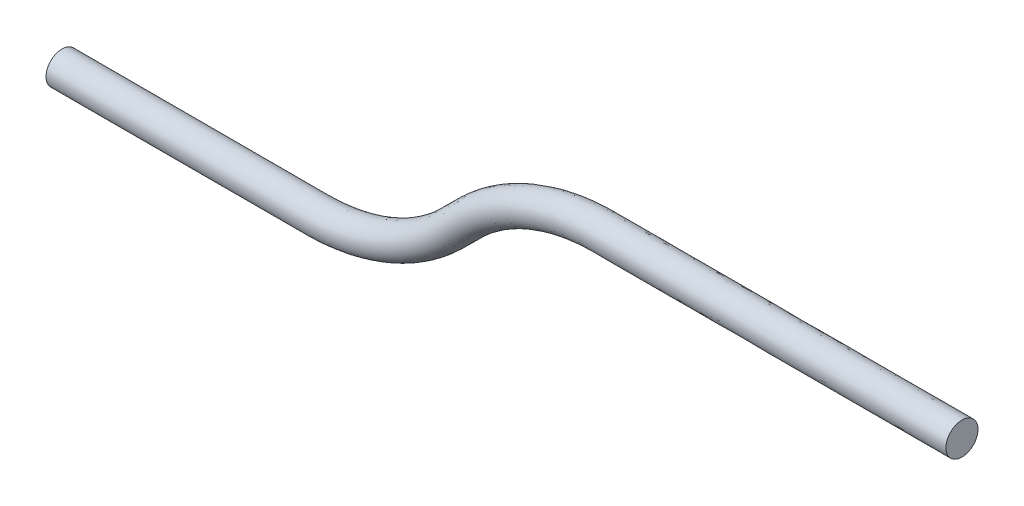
ISO-10303-21;
HEADER;
FILE_DESCRIPTION(('STEP AP214'),'2;1');
FILE_NAME('part.step','',(''),(''),'','','');
FILE_SCHEMA(('AUTOMOTIVE_DESIGN { 1 0 10303 214 1 1 1 1 }'));
ENDSEC;
DATA;
#1=APPLICATION_CONTEXT('core data for automotive mechanical design processes');
#2=APPLICATION_PROTOCOL_DEFINITION('international standard','automotive_design',2000,#1);
#3=PRODUCT_CONTEXT('',#1,'mechanical');
#4=PRODUCT('Part','Part','',(#3));
#5=PRODUCT_RELATED_PRODUCT_CATEGORY('part','',(#4));
#6=PRODUCT_DEFINITION_FORMATION('','',#4);
#7=PRODUCT_DEFINITION_CONTEXT('part definition',#1,'design');
#8=PRODUCT_DEFINITION('design','',#6,#7);
#9=PRODUCT_DEFINITION_SHAPE('','',#8);
#10=(LENGTH_UNIT() NAMED_UNIT(*) SI_UNIT(.MILLI.,.METRE.));
#11=(NAMED_UNIT(*) PLANE_ANGLE_UNIT() SI_UNIT($,.RADIAN.));
#12=(NAMED_UNIT(*) SI_UNIT($,.STERADIAN.) SOLID_ANGLE_UNIT());
#13=UNCERTAINTY_MEASURE_WITH_UNIT(LENGTH_MEASURE(1.E-05),#10,'distance_accuracy_value','');
#14=(GEOMETRIC_REPRESENTATION_CONTEXT(3) GLOBAL_UNCERTAINTY_ASSIGNED_CONTEXT((#13)) GLOBAL_UNIT_ASSIGNED_CONTEXT((#10,
#11,#12)) REPRESENTATION_CONTEXT('',''));
#15=CARTESIAN_POINT('',(0.,0.,0.));
#16=DIRECTION('',(0.,0.,1.));
#17=DIRECTION('',(1.,0.,0.));
#18=AXIS2_PLACEMENT_3D('',#15,#16,#17);
#19=CARTESIAN_POINT('',(0.,62.1823901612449,0.));
#20=DIRECTION('',(1.,0.,0.));
#21=DIRECTION('',(0.,1.,0.));
#22=AXIS2_PLACEMENT_3D('',#19,#20,#21);
#23=PLANE('',#22);
#24=CARTESIAN_POINT('',(0.,57.2125,0.));
#25=CARTESIAN_POINT('',(0.,57.2125,0.741304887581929));
#26=CARTESIAN_POINT('',(0.,57.9264872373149,2.22391466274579));
#27=CARTESIAN_POINT('',(0.,60.3329593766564,2.77317622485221));
#28=CARTESIAN_POINT('',(0.,62.2628001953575,1.23417952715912));
#29=CARTESIAN_POINT('',(0.,62.2628001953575,-1.23417952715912));
#30=CARTESIAN_POINT('',(0.,60.3329593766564,-2.77317622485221));
#31=CARTESIAN_POINT('',(0.,57.9264872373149,-2.22391466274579));
#32=CARTESIAN_POINT('',(0.,57.2125,-0.741304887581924));
#33=CARTESIAN_POINT('',(0.,57.2125,0.));
#34=B_SPLINE_CURVE_WITH_KNOTS('',3,(#24,#25,#26,#27,#28,#29,#30,#31,#32,#33),.UNSPECIFIED.,.T.,
.F.,(4,1,1,1,1,1,1,4),(0.,0.142857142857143,0.285714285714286,0.428571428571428,
0.571428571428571,0.714285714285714,0.857142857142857,1.),.UNSPECIFIED.);
#35=CARTESIAN_POINT('',(0.,57.2125,0.));
#36=VERTEX_POINT('',#35);
#37=EDGE_CURVE('E24',#36,#36,#34,.T.);
#38=ORIENTED_EDGE('',*,*,#37,.T.);
#39=EDGE_LOOP('',(#38));
#40=FACE_BOUND('',#39,.T.);
#41=ADVANCED_FACE('F14',(#40),#23,.F.);
#42=CARTESIAN_POINT('',(139.3,82.0823901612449,0.));
#43=DIRECTION('',(1.,0.,0.));
#44=DIRECTION('',(0.,0.,-1.));
#45=AXIS2_PLACEMENT_3D('',#42,#43,#44);
#46=PLANE('',#45);
#47=CARTESIAN_POINT('',(139.3,77.1125,0.));
#48=CARTESIAN_POINT('',(139.3,77.1125,0.741304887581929));
#49=CARTESIAN_POINT('',(139.3,77.8264872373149,2.22391466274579));
#50=CARTESIAN_POINT('',(139.3,80.2329593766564,2.77317622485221));
#51=CARTESIAN_POINT('',(139.3,82.1628001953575,1.23417952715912));
#52=CARTESIAN_POINT('',(139.3,82.1628001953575,-1.23417952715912));
#53=CARTESIAN_POINT('',(139.3,80.2329593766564,-2.77317622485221));
#54=CARTESIAN_POINT('',(139.3,77.8264872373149,-2.22391466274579));
#55=CARTESIAN_POINT('',(139.3,77.1125,-0.741304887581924));
#56=CARTESIAN_POINT('',(139.3,77.1125,0.));
#57=B_SPLINE_CURVE_WITH_KNOTS('',3,(#47,#48,#49,#50,#51,#52,#53,#54,#55,#56),.UNSPECIFIED.,.T.,
.F.,(4,1,1,1,1,1,1,4),(0.,0.142857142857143,0.285714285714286,0.428571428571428,
0.571428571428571,0.714285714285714,0.857142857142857,1.),.UNSPECIFIED.);
#58=CARTESIAN_POINT('',(139.3,77.1125,0.));
#59=VERTEX_POINT('',#58);
#60=EDGE_CURVE('E10',#59,#59,#57,.F.);
#61=ORIENTED_EDGE('',*,*,#60,.T.);
#62=EDGE_LOOP('',(#61));
#63=FACE_BOUND('',#62,.T.);
#64=ADVANCED_FACE('F16',(#63),#46,.T.);
#65=CARTESIAN_POINT('',(0.,57.2125,0.));
#66=CARTESIAN_POINT('',(13.1252417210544,57.2125,0.));
#67=CARTESIAN_POINT('',(26.2504834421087,57.2125,0.));
#68=CARTESIAN_POINT('',(39.3757251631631,57.2125,0.));
#69=CARTESIAN_POINT('',(41.4927184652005,57.2125,0.));
#70=CARTESIAN_POINT('',(45.7248946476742,57.6294208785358,0.));
#71=CARTESIAN_POINT('',(51.8305417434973,59.4814128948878,0.));
#72=CARTESIAN_POINT('',(57.4574423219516,62.4892012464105,0.));
#73=CARTESIAN_POINT('',(60.7448503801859,65.1869941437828,0.));
#74=CARTESIAN_POINT('',(62.2417906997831,66.68393446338,0.));
#75=CARTESIAN_POINT('',(63.0465489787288,67.4886927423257,0.));
#76=CARTESIAN_POINT('',(63.8513072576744,68.2934510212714,0.));
#77=CARTESIAN_POINT('',(64.6560655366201,69.098209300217,0.));
#78=CARTESIAN_POINT('',(65.9220201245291,70.364163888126,0.));
#79=CARTESIAN_POINT('',(68.7046446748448,72.647918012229,0.));
#80=CARTESIAN_POINT('',(73.4656194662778,75.19256472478,0.));
#81=CARTESIAN_POINT('',(78.6314739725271,76.7597453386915,0.));
#82=CARTESIAN_POINT('',(82.2139446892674,77.1125,0.));
#83=CARTESIAN_POINT('',(84.0042748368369,77.1125,0.));
#84=CARTESIAN_POINT('',(102.436183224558,77.1125,0.));
#85=CARTESIAN_POINT('',(120.868091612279,77.1125,0.));
#86=CARTESIAN_POINT('',(139.3,77.1125,0.));
#87=CARTESIAN_POINT('',(0.,57.2125,0.741304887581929));
#88=CARTESIAN_POINT('',(13.1252417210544,57.2125,0.741304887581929));
#89=CARTESIAN_POINT('',(26.2504834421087,57.2125,0.741304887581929));
#90=CARTESIAN_POINT('',(39.3757251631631,57.2125,0.741304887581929));
#91=CARTESIAN_POINT('',(41.4927184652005,57.2125,0.741304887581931));
#92=CARTESIAN_POINT('',(45.7248946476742,57.6294208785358,0.741304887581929));
#93=CARTESIAN_POINT('',(51.8305417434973,59.4814128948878,0.741304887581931));
#94=CARTESIAN_POINT('',(57.4574423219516,62.4892012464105,0.741304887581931));
#95=CARTESIAN_POINT('',(60.7448503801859,65.1869941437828,0.741304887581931));
#96=CARTESIAN_POINT('',(62.2417906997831,66.68393446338,0.741304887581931));
#97=CARTESIAN_POINT('',(63.0465489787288,67.4886927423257,0.741304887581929));
#98=CARTESIAN_POINT('',(63.8513072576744,68.2934510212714,0.741304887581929));
#99=CARTESIAN_POINT('',(64.6560655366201,69.098209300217,0.741304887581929));
#100=CARTESIAN_POINT('',(65.9220201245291,70.364163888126,0.741304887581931));
#101=CARTESIAN_POINT('',(68.7046446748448,72.647918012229,0.741304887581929));
#102=CARTESIAN_POINT('',(73.4656194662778,75.19256472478,0.741304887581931));
#103=CARTESIAN_POINT('',(78.6314739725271,76.7597453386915,0.741304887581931));
#104=CARTESIAN_POINT('',(82.2139446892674,77.1125,0.741304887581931));
#105=CARTESIAN_POINT('',(84.0042748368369,77.1125,0.741304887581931));
#106=CARTESIAN_POINT('',(102.436183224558,77.1125,0.741304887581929));
#107=CARTESIAN_POINT('',(120.868091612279,77.1125,0.741304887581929));
#108=CARTESIAN_POINT('',(139.3,77.1125,0.741304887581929));
#109=CARTESIAN_POINT('',(0.,57.9264872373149,2.22391466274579));
#110=CARTESIAN_POINT('',(13.1252417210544,57.9264872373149,2.22391466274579));
#111=CARTESIAN_POINT('',(26.2504834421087,57.9264872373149,2.22391466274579));
#112=CARTESIAN_POINT('',(39.3757251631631,57.9264872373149,2.22391466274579));
#113=CARTESIAN_POINT('',(41.4458373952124,57.9264872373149,2.22391466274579));
#114=CARTESIAN_POINT('',(45.5847710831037,58.3341992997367,2.22391466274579));
#115=CARTESIAN_POINT('',(51.5555438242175,60.1453166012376,2.22391466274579));
#116=CARTESIAN_POINT('',(57.0581710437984,63.0866371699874,2.22391466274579));
#117=CARTESIAN_POINT('',(60.2731350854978,65.7250092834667,2.22391466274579));
#118=CARTESIAN_POINT('',(61.7369254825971,67.188799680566,2.22391466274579));
#119=CARTESIAN_POINT('',(62.5416837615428,67.9935579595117,2.22391466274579));
#120=CARTESIAN_POINT('',(63.3464420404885,68.7983162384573,2.22391466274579));
#121=CARTESIAN_POINT('',(64.1512003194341,69.603074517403,2.22391466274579));
#122=CARTESIAN_POINT('',(65.450304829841,70.9021790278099,2.22391466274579));
#123=CARTESIAN_POINT('',(68.3053733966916,73.2453539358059,2.22391466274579));
#124=CARTESIAN_POINT('',(73.1906215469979,75.8564684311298,2.22391466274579));
#125=CARTESIAN_POINT('',(78.4913504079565,77.4645237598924,2.22391466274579));
#126=CARTESIAN_POINT('',(82.1670636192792,77.8264872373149,2.22391466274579));
#127=CARTESIAN_POINT('',(84.0042748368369,77.8264872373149,2.22391466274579));
#128=CARTESIAN_POINT('',(102.436183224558,77.8264872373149,2.22391466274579));
#129=CARTESIAN_POINT('',(120.868091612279,77.8264872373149,2.22391466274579));
#130=CARTESIAN_POINT('',(139.3,77.8264872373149,2.22391466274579));
#131=CARTESIAN_POINT('',(0.,60.3329593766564,2.77317622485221));
#132=CARTESIAN_POINT('',(13.1252417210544,60.3329593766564,2.77317622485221));
#133=CARTESIAN_POINT('',(26.2504834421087,60.3329593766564,2.77317622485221));
#134=CARTESIAN_POINT('',(39.3757251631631,60.3329593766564,2.77317622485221));
#135=CARTESIAN_POINT('',(41.2878261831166,60.3329593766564,2.77317622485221));
#136=CARTESIAN_POINT('',(45.1124888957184,60.7096334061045,2.77317622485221));
#137=CARTESIAN_POINT('',(50.6286717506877,62.3829837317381,2.77317622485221));
#138=CARTESIAN_POINT('',(55.7124394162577,65.1002766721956,2.77317622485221));
#139=CARTESIAN_POINT('',(58.6832331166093,67.5383728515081,2.77317622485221));
#140=CARTESIAN_POINT('',(60.0352927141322,68.8904324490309,2.77317622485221));
#141=CARTESIAN_POINT('',(60.8400509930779,69.6951907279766,2.77317622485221));
#142=CARTESIAN_POINT('',(61.6448092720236,70.4999490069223,2.77317622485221));
#143=CARTESIAN_POINT('',(62.4495675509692,71.3047072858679,2.77317622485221));
#144=CARTESIAN_POINT('',(63.8604028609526,72.7155425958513,2.77317622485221));
#145=CARTESIAN_POINT('',(66.9596417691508,75.2589934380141,2.77317622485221));
#146=CARTESIAN_POINT('',(72.2637494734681,78.0941355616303,2.77317622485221));
#147=CARTESIAN_POINT('',(78.0190682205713,79.8399578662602,2.77317622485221));
#148=CARTESIAN_POINT('',(82.0090524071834,80.2329593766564,2.77317622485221));
#149=CARTESIAN_POINT('',(84.0042748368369,80.2329593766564,2.77317622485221));
#150=CARTESIAN_POINT('',(102.436183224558,80.2329593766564,2.77317622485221));
#151=CARTESIAN_POINT('',(120.868091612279,80.2329593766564,2.77317622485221));
#152=CARTESIAN_POINT('',(139.3,80.2329593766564,2.77317622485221));
#153=CARTESIAN_POINT('',(0.,62.2628001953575,1.23417952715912));
#154=CARTESIAN_POINT('',(13.1252417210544,62.2628001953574,1.23417952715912));
#155=CARTESIAN_POINT('',(26.2504834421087,62.2628001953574,1.23417952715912));
#156=CARTESIAN_POINT('',(39.3757251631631,62.2628001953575,1.23417952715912));
#157=CARTESIAN_POINT('',(41.1611110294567,62.2628001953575,1.23417952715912));
#158=CARTESIAN_POINT('',(44.7337479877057,62.6145836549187,1.23417952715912));
#159=CARTESIAN_POINT('',(49.8853780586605,64.1774534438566,1.23417952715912));
#160=CARTESIAN_POINT('',(54.6332464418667,66.7150901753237,1.23417952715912));
#161=CARTESIAN_POINT('',(57.4082307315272,68.9925775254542,1.23417952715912));
#162=CARTESIAN_POINT('',(58.6706891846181,70.255035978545,1.23417952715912));
#163=CARTESIAN_POINT('',(59.4754474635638,71.0597942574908,1.23417952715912));
#164=CARTESIAN_POINT('',(60.2802057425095,71.8645525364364,1.23417952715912));
#165=CARTESIAN_POINT('',(61.0849640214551,72.669310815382,1.23417952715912));
#166=CARTESIAN_POINT('',(62.5854004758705,74.1697472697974,1.23417952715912));
#167=CARTESIAN_POINT('',(65.8804487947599,76.8738069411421,1.23417952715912));
#168=CARTESIAN_POINT('',(71.5204557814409,79.8886052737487,1.23417952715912));
#169=CARTESIAN_POINT('',(77.6403273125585,81.7449081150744,1.23417952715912));
#170=CARTESIAN_POINT('',(81.8823372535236,82.1628001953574,1.23417952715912));
#171=CARTESIAN_POINT('',(84.0042748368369,82.1628001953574,1.23417952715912));
#172=CARTESIAN_POINT('',(102.436183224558,82.1628001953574,1.23417952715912));
#173=CARTESIAN_POINT('',(120.868091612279,82.1628001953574,1.23417952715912));
#174=CARTESIAN_POINT('',(139.3,82.1628001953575,1.23417952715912));
#175=CARTESIAN_POINT('',(0.,62.2628001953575,-1.23417952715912));
#176=CARTESIAN_POINT('',(13.1252417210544,62.2628001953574,-1.23417952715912));
#177=CARTESIAN_POINT('',(26.2504834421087,62.2628001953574,-1.23417952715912));
#178=CARTESIAN_POINT('',(39.3757251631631,62.2628001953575,-1.23417952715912));
#179=CARTESIAN_POINT('',(41.1611110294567,62.2628001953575,-1.23417952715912));
#180=CARTESIAN_POINT('',(44.7337479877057,62.6145836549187,-1.23417952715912));
#181=CARTESIAN_POINT('',(49.8853780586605,64.1774534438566,-1.23417952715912));
#182=CARTESIAN_POINT('',(54.6332464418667,66.7150901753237,-1.23417952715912));
#183=CARTESIAN_POINT('',(57.4082307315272,68.9925775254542,-1.23417952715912));
#184=CARTESIAN_POINT('',(58.6706891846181,70.255035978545,-1.23417952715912));
#185=CARTESIAN_POINT('',(59.4754474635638,71.0597942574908,-1.23417952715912));
#186=CARTESIAN_POINT('',(60.2802057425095,71.8645525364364,-1.23417952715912));
#187=CARTESIAN_POINT('',(61.0849640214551,72.669310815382,-1.23417952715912));
#188=CARTESIAN_POINT('',(62.5854004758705,74.1697472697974,-1.23417952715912));
#189=CARTESIAN_POINT('',(65.8804487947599,76.8738069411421,-1.23417952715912));
#190=CARTESIAN_POINT('',(71.5204557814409,79.8886052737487,-1.23417952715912));
#191=CARTESIAN_POINT('',(77.6403273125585,81.7449081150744,-1.23417952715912));
#192=CARTESIAN_POINT('',(81.8823372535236,82.1628001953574,-1.23417952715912));
#193=CARTESIAN_POINT('',(84.0042748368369,82.1628001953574,-1.23417952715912));
#194=CARTESIAN_POINT('',(102.436183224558,82.1628001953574,-1.23417952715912));
#195=CARTESIAN_POINT('',(120.868091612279,82.1628001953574,-1.23417952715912));
#196=CARTESIAN_POINT('',(139.3,82.1628001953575,-1.23417952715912));
#197=CARTESIAN_POINT('',(0.,60.3329593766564,-2.77317622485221));
#198=CARTESIAN_POINT('',(13.1252417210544,60.3329593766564,-2.77317622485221));
#199=CARTESIAN_POINT('',(26.2504834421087,60.3329593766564,-2.77317622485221));
#200=CARTESIAN_POINT('',(39.3757251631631,60.3329593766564,-2.77317622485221));
#201=CARTESIAN_POINT('',(41.2878261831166,60.3329593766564,-2.77317622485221));
#202=CARTESIAN_POINT('',(45.1124888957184,60.7096334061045,-2.77317622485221));
#203=CARTESIAN_POINT('',(50.6286717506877,62.3829837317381,-2.77317622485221));
#204=CARTESIAN_POINT('',(55.7124394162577,65.1002766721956,-2.77317622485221));
#205=CARTESIAN_POINT('',(58.6832331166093,67.5383728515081,-2.77317622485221));
#206=CARTESIAN_POINT('',(60.0352927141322,68.8904324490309,-2.77317622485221));
#207=CARTESIAN_POINT('',(60.8400509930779,69.6951907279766,-2.77317622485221));
#208=CARTESIAN_POINT('',(61.6448092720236,70.4999490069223,-2.77317622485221));
#209=CARTESIAN_POINT('',(62.4495675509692,71.3047072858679,-2.77317622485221));
#210=CARTESIAN_POINT('',(63.8604028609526,72.7155425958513,-2.77317622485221));
#211=CARTESIAN_POINT('',(66.9596417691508,75.2589934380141,-2.77317622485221));
#212=CARTESIAN_POINT('',(72.2637494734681,78.0941355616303,-2.77317622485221));
#213=CARTESIAN_POINT('',(78.0190682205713,79.8399578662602,-2.77317622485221));
#214=CARTESIAN_POINT('',(82.0090524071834,80.2329593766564,-2.77317622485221));
#215=CARTESIAN_POINT('',(84.0042748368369,80.2329593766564,-2.77317622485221));
#216=CARTESIAN_POINT('',(102.436183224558,80.2329593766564,-2.77317622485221));
#217=CARTESIAN_POINT('',(120.868091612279,80.2329593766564,-2.77317622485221));
#218=CARTESIAN_POINT('',(139.3,80.2329593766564,-2.77317622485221));
#219=CARTESIAN_POINT('',(0.,57.9264872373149,-2.22391466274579));
#220=CARTESIAN_POINT('',(13.1252417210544,57.9264872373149,-2.22391466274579));
#221=CARTESIAN_POINT('',(26.2504834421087,57.9264872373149,-2.22391466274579));
#222=CARTESIAN_POINT('',(39.3757251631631,57.9264872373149,-2.22391466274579));
#223=CARTESIAN_POINT('',(41.4458373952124,57.9264872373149,-2.22391466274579));
#224=CARTESIAN_POINT('',(45.5847710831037,58.3341992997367,-2.22391466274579));
#225=CARTESIAN_POINT('',(51.5555438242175,60.1453166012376,-2.22391466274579));
#226=CARTESIAN_POINT('',(57.0581710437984,63.0866371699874,-2.22391466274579));
#227=CARTESIAN_POINT('',(60.2731350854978,65.7250092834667,-2.22391466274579));
#228=CARTESIAN_POINT('',(61.7369254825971,67.188799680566,-2.22391466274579));
#229=CARTESIAN_POINT('',(62.5416837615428,67.9935579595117,-2.22391466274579));
#230=CARTESIAN_POINT('',(63.3464420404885,68.7983162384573,-2.22391466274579));
#231=CARTESIAN_POINT('',(64.1512003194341,69.603074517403,-2.22391466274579));
#232=CARTESIAN_POINT('',(65.450304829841,70.9021790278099,-2.22391466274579));
#233=CARTESIAN_POINT('',(68.3053733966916,73.2453539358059,-2.22391466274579));
#234=CARTESIAN_POINT('',(73.1906215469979,75.8564684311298,-2.22391466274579));
#235=CARTESIAN_POINT('',(78.4913504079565,77.4645237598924,-2.22391466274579));
#236=CARTESIAN_POINT('',(82.1670636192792,77.8264872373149,-2.22391466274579));
#237=CARTESIAN_POINT('',(84.0042748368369,77.8264872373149,-2.22391466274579));
#238=CARTESIAN_POINT('',(102.436183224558,77.8264872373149,-2.22391466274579));
#239=CARTESIAN_POINT('',(120.868091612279,77.8264872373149,-2.22391466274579));
#240=CARTESIAN_POINT('',(139.3,77.8264872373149,-2.22391466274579));
#241=CARTESIAN_POINT('',(0.,57.2125,-0.741304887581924));
#242=CARTESIAN_POINT('',(13.1252417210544,57.2125,-0.741304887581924));
#243=CARTESIAN_POINT('',(26.2504834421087,57.2125,-0.741304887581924));
#244=CARTESIAN_POINT('',(39.3757251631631,57.2125,-0.741304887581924));
#245=CARTESIAN_POINT('',(41.4927184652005,57.2125,-0.741304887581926));
#246=CARTESIAN_POINT('',(45.7248946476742,57.6294208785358,-0.741304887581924));
#247=CARTESIAN_POINT('',(51.8305417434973,59.4814128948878,-0.741304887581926));
#248=CARTESIAN_POINT('',(57.4574423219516,62.4892012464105,-0.741304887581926));
#249=CARTESIAN_POINT('',(60.7448503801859,65.1869941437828,-0.741304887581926));
#250=CARTESIAN_POINT('',(62.2417906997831,66.68393446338,-0.741304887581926));
#251=CARTESIAN_POINT('',(63.0465489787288,67.4886927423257,-0.741304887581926));
#252=CARTESIAN_POINT('',(63.8513072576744,68.2934510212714,-0.741304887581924));
#253=CARTESIAN_POINT('',(64.6560655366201,69.098209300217,-0.741304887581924));
#254=CARTESIAN_POINT('',(65.9220201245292,70.364163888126,-0.741304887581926));
#255=CARTESIAN_POINT('',(68.7046446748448,72.647918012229,-0.741304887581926));
#256=CARTESIAN_POINT('',(73.4656194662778,75.19256472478,-0.741304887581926));
#257=CARTESIAN_POINT('',(78.6314739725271,76.7597453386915,-0.741304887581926));
#258=CARTESIAN_POINT('',(82.2139446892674,77.1125,-0.741304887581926));
#259=CARTESIAN_POINT('',(84.0042748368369,77.1125,-0.741304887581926));
#260=CARTESIAN_POINT('',(102.436183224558,77.1125,-0.741304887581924));
#261=CARTESIAN_POINT('',(120.868091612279,77.1125,-0.741304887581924));
#262=CARTESIAN_POINT('',(139.3,77.1125,-0.741304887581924));
#263=CARTESIAN_POINT('',(0.,57.2125,0.));
#264=CARTESIAN_POINT('',(13.1252417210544,57.2125,0.));
#265=CARTESIAN_POINT('',(26.2504834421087,57.2125,0.));
#266=CARTESIAN_POINT('',(39.3757251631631,57.2125,0.));
#267=CARTESIAN_POINT('',(41.4927184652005,57.2125,0.));
#268=CARTESIAN_POINT('',(45.7248946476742,57.6294208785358,0.));
#269=CARTESIAN_POINT('',(51.8305417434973,59.4814128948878,0.));
#270=CARTESIAN_POINT('',(57.4574423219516,62.4892012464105,0.));
#271=CARTESIAN_POINT('',(60.7448503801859,65.1869941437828,0.));
#272=CARTESIAN_POINT('',(62.2417906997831,66.68393446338,0.));
#273=CARTESIAN_POINT('',(63.0465489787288,67.4886927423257,0.));
#274=CARTESIAN_POINT('',(63.8513072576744,68.2934510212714,0.));
#275=CARTESIAN_POINT('',(64.6560655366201,69.098209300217,0.));
#276=CARTESIAN_POINT('',(65.9220201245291,70.364163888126,0.));
#277=CARTESIAN_POINT('',(68.7046446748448,72.647918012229,0.));
#278=CARTESIAN_POINT('',(73.4656194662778,75.19256472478,0.));
#279=CARTESIAN_POINT('',(78.6314739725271,76.7597453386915,0.));
#280=CARTESIAN_POINT('',(82.2139446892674,77.1125,0.));
#281=CARTESIAN_POINT('',(84.0042748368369,77.1125,0.));
#282=CARTESIAN_POINT('',(102.436183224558,77.1125,0.));
#283=CARTESIAN_POINT('',(120.868091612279,77.1125,0.));
#284=CARTESIAN_POINT('',(139.3,77.1125,0.));
#285=B_SPLINE_SURFACE_WITH_KNOTS('',3,3,((#65,#66,#67,#68,#69,#70,#71,#72,#73,#74,#75,#76,#77,
#78,#79,#80,#81,#82,#83,#84,#85,#86),(#87,#88,#89,#90,#91,#92,#93,#94,#95,#96,#97,#98,#99,#100,
#101,#102,#103,#104,#105,#106,#107,#108),(#109,#110,#111,#112,#113,#114,#115,#116,#117,#118,
#119,#120,#121,#122,#123,#124,#125,#126,#127,#128,#129,#130),(#131,#132,#133,#134,#135,#136,
#137,#138,#139,#140,#141,#142,#143,#144,#145,#146,#147,#148,#149,#150,#151,#152),(#153,#154,
#155,#156,#157,#158,#159,#160,#161,#162,#163,#164,#165,#166,#167,#168,#169,#170,#171,#172,#173,
#174),(#175,#176,#177,#178,#179,#180,#181,#182,#183,#184,#185,#186,#187,#188,#189,#190,#191,
#192,#193,#194,#195,#196),(#197,#198,#199,#200,#201,#202,#203,#204,#205,#206,#207,#208,#209,
#210,#211,#212,#213,#214,#215,#216,#217,#218),(#219,#220,#221,#222,#223,#224,#225,#226,#227,
#228,#229,#230,#231,#232,#233,#234,#235,#236,#237,#238,#239,#240),(#241,#242,#243,#244,#245,
#246,#247,#248,#249,#250,#251,#252,#253,#254,#255,#256,#257,#258,#259,#260,#261,#262),(#263,
#264,#265,#266,#267,#268,#269,#270,#271,#272,#273,#274,#275,#276,#277,#278,#279,#280,#281,#282,
#283,#284)),.UNSPECIFIED.,.T.,.F.,.F.,(4,1,1,1,1,1,1,4),(4,3,1,1,1,3,3,1,1,1,3,4),(0.,
0.142857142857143,0.285714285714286,0.428571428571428,0.571428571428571,0.714285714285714,
0.857142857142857,1.),(0.,1.,2.,3.,4.,5.,6.,7.,8.,9.,10.,11.),.UNSPECIFIED.);
#286=ORIENTED_EDGE('',*,*,#37,.F.);
#287=EDGE_LOOP('',(#286));
#288=FACE_BOUND('',#287,.T.);
#289=ORIENTED_EDGE('',*,*,#60,.F.);
#290=EDGE_LOOP('',(#289));
#291=FACE_BOUND('',#290,.T.);
#292=ADVANCED_FACE('F57',(#288,#291),#285,.F.);
#293=CLOSED_SHELL('',(#41,#64,#292));
#294=MANIFOLD_SOLID_BREP('B1',#293);
#295=ADVANCED_BREP_SHAPE_REPRESENTATION('',(#18,#294),#14);
#296=SHAPE_DEFINITION_REPRESENTATION(#9,#295);
ENDSEC;
END-ISO-10303-21;
